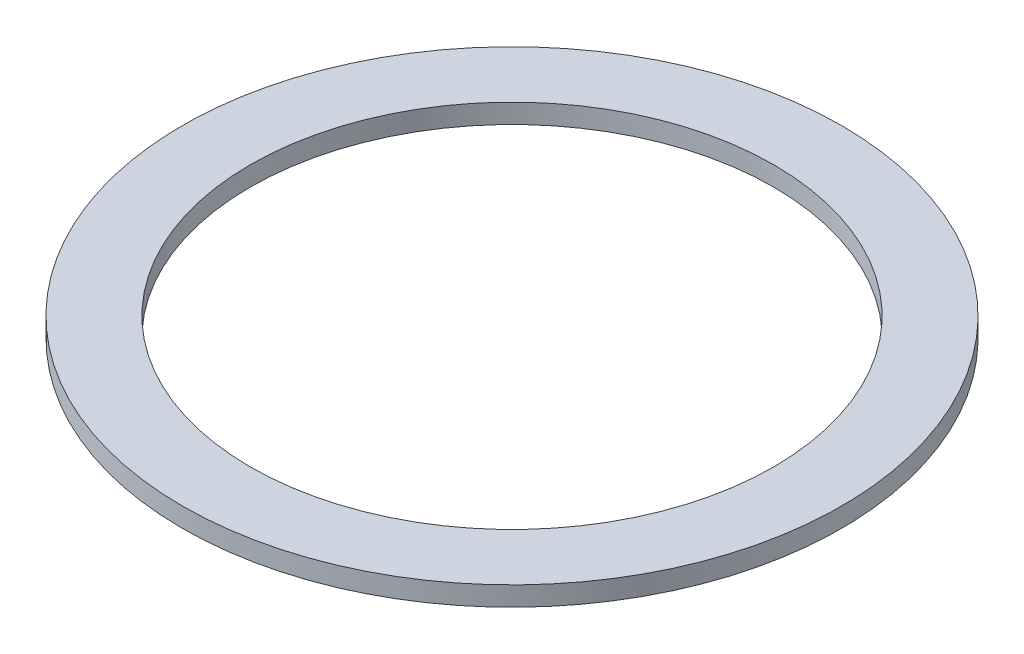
ISO-10303-21;
HEADER;
FILE_DESCRIPTION(('STEP AP214'),'2;1');
FILE_NAME('part.step','',(''),(''),'','','');
FILE_SCHEMA(('AUTOMOTIVE_DESIGN { 1 0 10303 214 1 1 1 1 }'));
ENDSEC;
DATA;
#1=APPLICATION_CONTEXT('core data for automotive mechanical design processes');
#2=APPLICATION_PROTOCOL_DEFINITION('international standard','automotive_design',2000,#1);
#3=PRODUCT_CONTEXT('',#1,'mechanical');
#4=PRODUCT('Part','Part','',(#3));
#5=PRODUCT_RELATED_PRODUCT_CATEGORY('part','',(#4));
#6=PRODUCT_DEFINITION_FORMATION('','',#4);
#7=PRODUCT_DEFINITION_CONTEXT('part definition',#1,'design');
#8=PRODUCT_DEFINITION('design','',#6,#7);
#9=PRODUCT_DEFINITION_SHAPE('','',#8);
#10=(LENGTH_UNIT() NAMED_UNIT(*) SI_UNIT(.MILLI.,.METRE.));
#11=(NAMED_UNIT(*) PLANE_ANGLE_UNIT() SI_UNIT($,.RADIAN.));
#12=(NAMED_UNIT(*) SI_UNIT($,.STERADIAN.) SOLID_ANGLE_UNIT());
#13=UNCERTAINTY_MEASURE_WITH_UNIT(LENGTH_MEASURE(1.E-05),#10,'distance_accuracy_value','');
#14=(GEOMETRIC_REPRESENTATION_CONTEXT(3) GLOBAL_UNCERTAINTY_ASSIGNED_CONTEXT((#13)) GLOBAL_UNIT_ASSIGNED_CONTEXT((#10,
#11,#12)) REPRESENTATION_CONTEXT('',''));
#15=CARTESIAN_POINT('',(0.,0.,0.));
#16=DIRECTION('',(0.,0.,1.));
#17=DIRECTION('',(1.,0.,0.));
#18=AXIS2_PLACEMENT_3D('',#15,#16,#17);
#19=CARTESIAN_POINT('',(0.,1.,0.));
#20=DIRECTION('',(0.,1.,0.));
#21=DIRECTION('',(0.,0.,1.));
#22=AXIS2_PLACEMENT_3D('',#19,#20,#21);
#23=PLANE('',#22);
#24=CARTESIAN_POINT('',(0.,1.,0.));
#25=DIRECTION('',(0.,1.,0.));
#26=DIRECTION('',(0.,0.,1.));
#27=AXIS2_PLACEMENT_3D('',#24,#25,#26);
#28=CIRCLE('',#27,17.);
#29=CARTESIAN_POINT('',(0.,1.,17.));
#30=VERTEX_POINT('',#29);
#31=EDGE_CURVE('E10',#30,#30,#28,.T.);
#32=ORIENTED_EDGE('',*,*,#31,.T.);
#33=EDGE_LOOP('',(#32));
#34=FACE_BOUND('',#33,.T.);
#35=CARTESIAN_POINT('',(0.,1.,0.));
#36=DIRECTION('',(0.,1.,0.));
#37=DIRECTION('',(0.,0.,1.));
#38=AXIS2_PLACEMENT_3D('',#35,#36,#37);
#39=CIRCLE('',#38,13.5);
#40=CARTESIAN_POINT('',(0.,1.,13.5));
#41=VERTEX_POINT('',#40);
#42=EDGE_CURVE('E35',#41,#41,#39,.T.);
#43=ORIENTED_EDGE('',*,*,#42,.F.);
#44=EDGE_LOOP('',(#43));
#45=FACE_BOUND('',#44,.T.);
#46=ADVANCED_FACE('F24',(#34,#45),#23,.T.);
#47=CARTESIAN_POINT('',(0.,0.,0.));
#48=DIRECTION('',(0.,1.,0.));
#49=DIRECTION('',(0.,0.,1.));
#50=AXIS2_PLACEMENT_3D('',#47,#48,#49);
#51=PLANE('',#50);
#52=CARTESIAN_POINT('',(0.,0.,0.));
#53=DIRECTION('',(0.,1.,0.));
#54=DIRECTION('',(0.,0.,1.));
#55=AXIS2_PLACEMENT_3D('',#52,#53,#54);
#56=CIRCLE('',#55,17.);
#57=CARTESIAN_POINT('',(0.,0.,17.));
#58=VERTEX_POINT('',#57);
#59=EDGE_CURVE('E31',#58,#58,#56,.T.);
#60=ORIENTED_EDGE('',*,*,#59,.F.);
#61=EDGE_LOOP('',(#60));
#62=FACE_BOUND('',#61,.T.);
#63=CARTESIAN_POINT('',(0.,0.,0.));
#64=DIRECTION('',(0.,1.,0.));
#65=DIRECTION('',(0.,0.,1.));
#66=AXIS2_PLACEMENT_3D('',#63,#64,#65);
#67=CIRCLE('',#66,13.5);
#68=CARTESIAN_POINT('',(0.,0.,13.5));
#69=VERTEX_POINT('',#68);
#70=EDGE_CURVE('E39',#69,#69,#67,.T.);
#71=ORIENTED_EDGE('',*,*,#70,.T.);
#72=EDGE_LOOP('',(#71));
#73=FACE_BOUND('',#72,.T.);
#74=ADVANCED_FACE('F45',(#62,#73),#51,.F.);
#75=CARTESIAN_POINT('',(0.,1.,0.));
#76=DIRECTION('',(0.,-1.,0.));
#77=DIRECTION('',(0.,0.,-1.));
#78=AXIS2_PLACEMENT_3D('',#75,#76,#77);
#79=CYLINDRICAL_SURFACE('',#78,17.);
#80=ORIENTED_EDGE('',*,*,#31,.F.);
#81=EDGE_LOOP('',(#80));
#82=FACE_BOUND('',#81,.T.);
#83=ORIENTED_EDGE('',*,*,#59,.T.);
#84=EDGE_LOOP('',(#83));
#85=FACE_BOUND('',#84,.T.);
#86=ADVANCED_FACE('F26',(#82,#85),#79,.T.);
#87=CARTESIAN_POINT('',(0.,1.,0.));
#88=DIRECTION('',(0.,-1.,0.));
#89=DIRECTION('',(0.,0.,-1.));
#90=AXIS2_PLACEMENT_3D('',#87,#88,#89);
#91=CYLINDRICAL_SURFACE('',#90,13.5);
#92=ORIENTED_EDGE('',*,*,#42,.T.);
#93=EDGE_LOOP('',(#92));
#94=FACE_BOUND('',#93,.T.);
#95=ORIENTED_EDGE('',*,*,#70,.F.);
#96=EDGE_LOOP('',(#95));
#97=FACE_BOUND('',#96,.T.);
#98=ADVANCED_FACE('F47',(#94,#97),#91,.F.);
#99=CLOSED_SHELL('',(#46,#74,#86,#98));
#100=MANIFOLD_SOLID_BREP('B2',#99);
#101=ADVANCED_BREP_SHAPE_REPRESENTATION('',(#18,#100),#14);
#102=SHAPE_DEFINITION_REPRESENTATION(#9,#101);
ENDSEC;
END-ISO-10303-21;
